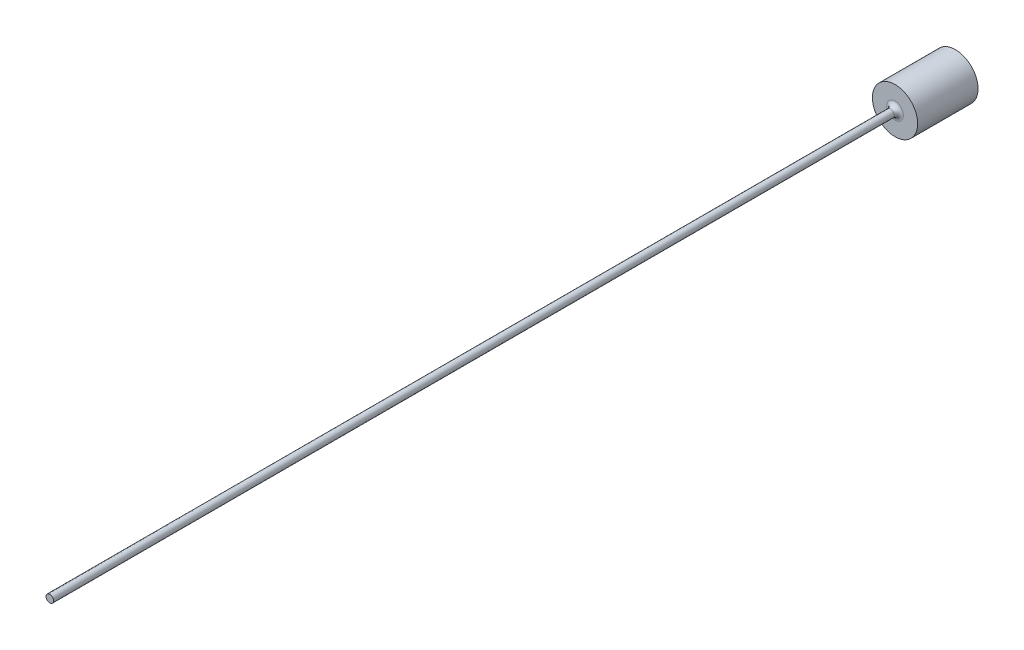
ISO-10303-21;
HEADER;
FILE_DESCRIPTION(('STEP AP214'),'2;1');
FILE_NAME('part.step','',(''),(''),'','','');
FILE_SCHEMA(('AUTOMOTIVE_DESIGN { 1 0 10303 214 1 1 1 1 }'));
ENDSEC;
DATA;
#1=APPLICATION_CONTEXT('core data for automotive mechanical design processes');
#2=APPLICATION_PROTOCOL_DEFINITION('international standard','automotive_design',2000,#1);
#3=PRODUCT_CONTEXT('',#1,'mechanical');
#4=PRODUCT('Part','Part','',(#3));
#5=PRODUCT_RELATED_PRODUCT_CATEGORY('part','',(#4));
#6=PRODUCT_DEFINITION_FORMATION('','',#4);
#7=PRODUCT_DEFINITION_CONTEXT('part definition',#1,'design');
#8=PRODUCT_DEFINITION('design','',#6,#7);
#9=PRODUCT_DEFINITION_SHAPE('','',#8);
#10=(LENGTH_UNIT() NAMED_UNIT(*) SI_UNIT(.MILLI.,.METRE.));
#11=(NAMED_UNIT(*) PLANE_ANGLE_UNIT() SI_UNIT($,.RADIAN.));
#12=(NAMED_UNIT(*) SI_UNIT($,.STERADIAN.) SOLID_ANGLE_UNIT());
#13=UNCERTAINTY_MEASURE_WITH_UNIT(LENGTH_MEASURE(1.E-05),#10,'distance_accuracy_value','');
#14=(GEOMETRIC_REPRESENTATION_CONTEXT(3) GLOBAL_UNCERTAINTY_ASSIGNED_CONTEXT((#13)) GLOBAL_UNIT_ASSIGNED_CONTEXT((#10,
#11,#12)) REPRESENTATION_CONTEXT('',''));
#15=CARTESIAN_POINT('',(0.,0.,0.));
#16=DIRECTION('',(0.,0.,1.));
#17=DIRECTION('',(1.,0.,0.));
#18=AXIS2_PLACEMENT_3D('',#15,#16,#17);
#19=CARTESIAN_POINT('',(1.5,0.,4.));
#20=DIRECTION('',(0.,0.,-1.));
#21=DIRECTION('',(-1.,0.,0.));
#22=AXIS2_PLACEMENT_3D('',#19,#20,#21);
#23=PLANE('',#22);
#24=CARTESIAN_POINT('',(0.,0.,4.));
#25=DIRECTION('',(0.,0.,-1.));
#26=DIRECTION('',(-1.,0.,0.));
#27=AXIS2_PLACEMENT_3D('',#24,#25,#26);
#28=CIRCLE('',#27,0.550000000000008);
#29=CARTESIAN_POINT('',(-0.550000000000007,0.,4.));
#30=VERTEX_POINT('',#29);
#31=EDGE_CURVE('E38',#30,#30,#28,.T.);
#32=ORIENTED_EDGE('',*,*,#31,.T.);
#33=EDGE_LOOP('',(#32));
#34=FACE_BOUND('',#33,.T.);
#35=CARTESIAN_POINT('',(0.,0.,4.));
#36=DIRECTION('',(0.,0.,-1.));
#37=DIRECTION('',(-1.,0.,0.));
#38=AXIS2_PLACEMENT_3D('',#35,#36,#37);
#39=CIRCLE('',#38,1.5);
#40=CARTESIAN_POINT('',(-1.5,0.,4.));
#41=VERTEX_POINT('',#40);
#42=EDGE_CURVE('E42',#41,#41,#39,.T.);
#43=ORIENTED_EDGE('',*,*,#42,.F.);
#44=EDGE_LOOP('',(#43));
#45=FACE_BOUND('',#44,.T.);
#46=ADVANCED_FACE('F31',(#34,#45),#23,.F.);
#47=CARTESIAN_POINT('',(0.,0.,-9.03322817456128));
#48=DIRECTION('',(0.,0.,-1.));
#49=DIRECTION('',(-1.,0.,0.));
#50=AXIS2_PLACEMENT_3D('',#47,#48,#49);
#51=CYLINDRICAL_SURFACE('',#50,1.5);
#52=CARTESIAN_POINT('',(0.,0.,0.));
#53=DIRECTION('',(0.,0.,-1.));
#54=DIRECTION('',(-1.,0.,0.));
#55=AXIS2_PLACEMENT_3D('',#52,#53,#54);
#56=CIRCLE('',#55,1.5);
#57=CARTESIAN_POINT('',(-1.5,0.,0.));
#58=VERTEX_POINT('',#57);
#59=EDGE_CURVE('E46',#58,#58,#56,.T.);
#60=ORIENTED_EDGE('',*,*,#59,.F.);
#61=EDGE_LOOP('',(#60));
#62=FACE_BOUND('',#61,.T.);
#63=ORIENTED_EDGE('',*,*,#42,.T.);
#64=EDGE_LOOP('',(#63));
#65=FACE_BOUND('',#64,.T.);
#66=ADVANCED_FACE('F66',(#62,#65),#51,.T.);
#67=CARTESIAN_POINT('',(0.,0.,0.));
#68=DIRECTION('',(0.,0.,1.));
#69=DIRECTION('',(1.,0.,0.));
#70=AXIS2_PLACEMENT_3D('',#67,#68,#69);
#71=PLANE('',#70);
#72=ORIENTED_EDGE('',*,*,#59,.T.);
#73=EDGE_LOOP('',(#72));
#74=FACE_BOUND('',#73,.T.);
#75=ADVANCED_FACE('F59',(#74),#71,.F.);
#76=CARTESIAN_POINT('',(0.,0.,60.));
#77=DIRECTION('',(0.,0.,-1.));
#78=DIRECTION('',(-1.,0.,0.));
#79=AXIS2_PLACEMENT_3D('',#76,#77,#78);
#80=PLANE('',#79);
#81=CARTESIAN_POINT('',(0.,0.,60.));
#82=DIRECTION('',(0.,0.,-1.));
#83=DIRECTION('',(-1.,0.,0.));
#84=AXIS2_PLACEMENT_3D('',#81,#82,#83);
#85=CIRCLE('',#84,0.250000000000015);
#86=CARTESIAN_POINT('',(-0.25000000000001,0.,60.));
#87=VERTEX_POINT('',#86);
#88=EDGE_CURVE('E51',#87,#87,#85,.T.);
#89=ORIENTED_EDGE('',*,*,#88,.F.);
#90=EDGE_LOOP('',(#89));
#91=FACE_BOUND('',#90,.T.);
#92=ADVANCED_FACE('F57',(#91),#80,.F.);
#93=CARTESIAN_POINT('',(0.,0.,-9.03322817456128));
#94=DIRECTION('',(0.,0.,-1.));
#95=DIRECTION('',(-1.,0.,0.));
#96=AXIS2_PLACEMENT_3D('',#93,#94,#95);
#97=CYLINDRICAL_SURFACE('',#96,0.250000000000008);
#98=CARTESIAN_POINT('',(0.,0.,4.3));
#99=DIRECTION('',(0.,0.,-1.));
#100=DIRECTION('',(-1.,0.,0.));
#101=AXIS2_PLACEMENT_3D('',#98,#99,#100);
#102=CIRCLE('',#101,0.250000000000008);
#103=CARTESIAN_POINT('',(-0.250000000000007,0.,4.3));
#104=VERTEX_POINT('',#103);
#105=EDGE_CURVE('E10',#104,#104,#102,.F.);
#106=ORIENTED_EDGE('',*,*,#105,.T.);
#107=EDGE_LOOP('',(#106));
#108=FACE_BOUND('',#107,.T.);
#109=ORIENTED_EDGE('',*,*,#88,.T.);
#110=EDGE_LOOP('',(#109));
#111=FACE_BOUND('',#110,.T.);
#112=ADVANCED_FACE('F55',(#108,#111),#97,.T.);
#113=CARTESIAN_POINT('',(0.,0.,4.3));
#114=DIRECTION('',(0.,0.,-1.));
#115=DIRECTION('',(-1.,0.,0.));
#116=AXIS2_PLACEMENT_3D('',#113,#114,#115);
#117=TOROIDAL_SURFACE('',#116,0.550000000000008,0.3);
#118=ORIENTED_EDGE('',*,*,#105,.F.);
#119=EDGE_LOOP('',(#118));
#120=FACE_BOUND('',#119,.T.);
#121=ORIENTED_EDGE('',*,*,#31,.F.);
#122=EDGE_LOOP('',(#121));
#123=FACE_BOUND('',#122,.T.);
#124=ADVANCED_FACE('F33',(#120,#123),#117,.F.);
#125=CLOSED_SHELL('',(#46,#66,#75,#92,#112,#124));
#126=MANIFOLD_SOLID_BREP('B2',#125);
#127=ADVANCED_BREP_SHAPE_REPRESENTATION('',(#18,#126),#14);
#128=SHAPE_DEFINITION_REPRESENTATION(#9,#127);
ENDSEC;
END-ISO-10303-21;
